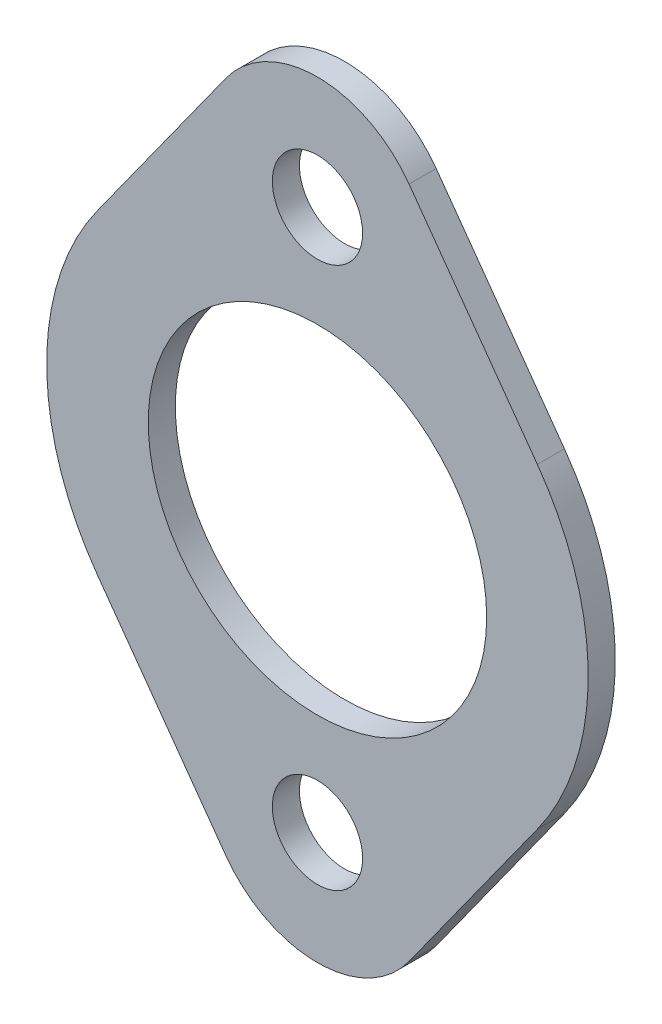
from build123d import *

# Parameters (mm, degrees)
MAIN_DEPTH  = 3.81
SKETCH2_R   = 6.35
SKETCH2_R_2 = 23.8125
HOLES_DEPTH = 67.177237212


with BuildPart() as part:
    # Sketch1 → Main (new body)
    with BuildSketch(Plane.XY):
        with BuildLine():
            Line((12.894196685, 47.360416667), (30.946072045, 22.225))
            ThreePointArc((30.946072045, 22.225), (38.1, 0), (30.946072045, -22.225))
            Line((30.946072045, -22.225), (12.894196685, -47.360416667))
            ThreePointArc((12.894196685, -47.360416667), (0, -53.975), (-12.894196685, -47.360416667))
            Line((-12.894196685, -47.360416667), (-30.946072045, -22.225))
            ThreePointArc((-30.946072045, -22.225), (-38.1, 0), (-30.946072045, 22.225))
            Line((-30.946072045, 22.225), (-12.894196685, 47.360416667))
            ThreePointArc((-12.894196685, 47.360416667), (0, 53.975), (12.894196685, 47.360416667))
        make_face()
    extrude(amount=MAIN_DEPTH)

    # Sketch2 → Holes (cut, through all)
    with BuildSketch(Plane.XY.offset(3.81)):
        with Locations((0, 38.1)):
            Circle(SKETCH2_R)
        with Locations((0, -38.1)):
            Circle(SKETCH2_R)
        Circle(SKETCH2_R_2)
    extrude(amount=-HOLES_DEPTH, mode=Mode.SUBTRACT)


solid = part.part
